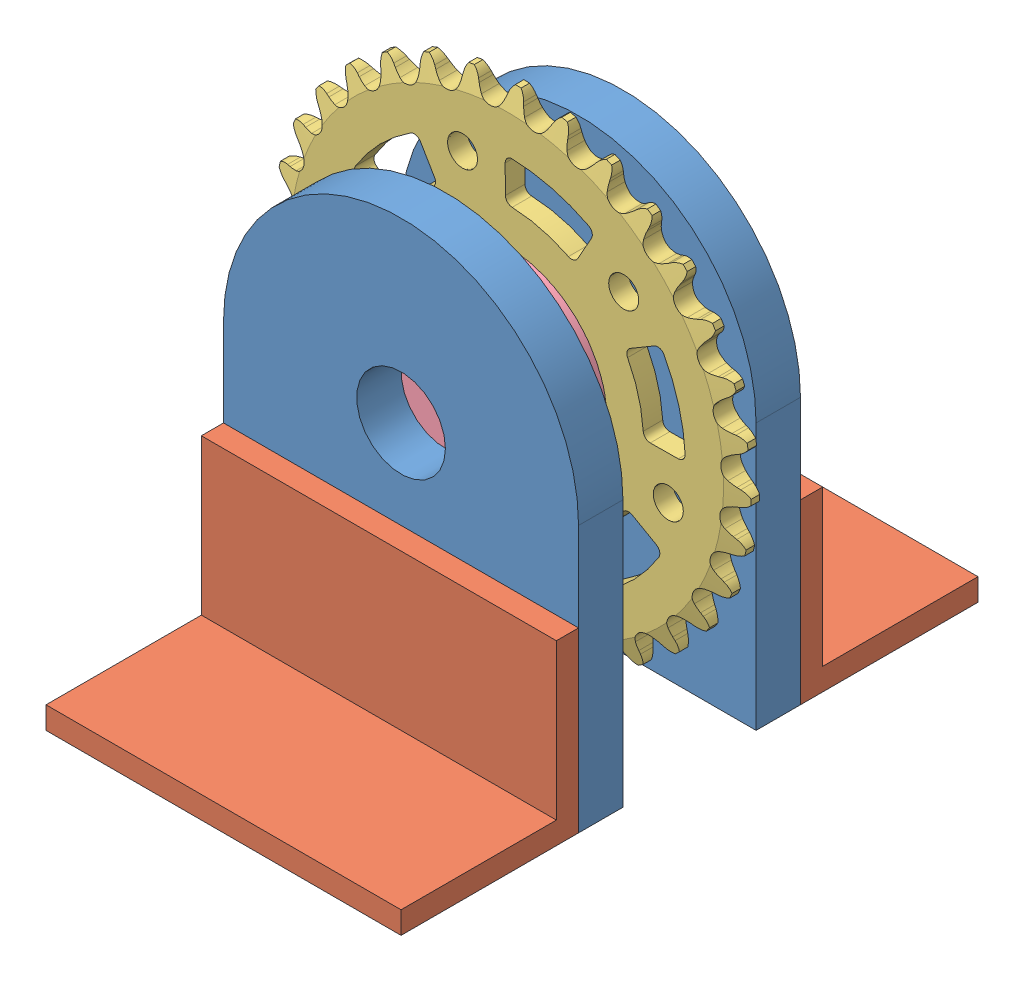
SolidWorks assembly Bottom Sprocket.SLDASM, configuration Default (file format 7000). Lengths in mm.
Overall size (83.76 83.76 82.55).
6 component instances, 4 part files, 12 mates.
Components (placement in the parent):
- Bottom sprocket mount-1: Bottom sprocket mount.SLDPRT [Default] at (2.3148 27.7191 63.7093) size (50.8 63.5 6.35)
- Sprocket mount to the bottom-1: Sprocket mount to the bottom.SLDPRT [Default] at (2.3148 8.6691 79.5843) size (50.8 25.4 25.4)
- 2_32tvexsprocket-1: 2_32tvexsprocket.SLDPRT [Default] at (2.3148 34.0691 48.9122) x (0.963427 0.26797 0) z (0 0 1) size (68.02 68.02 2.79)
- flanged round bearing half inch-1: flanged round bearing half inch.SLDPRT [Default] at (2.3148 34.0691 55.2622) x (1 0 0) z (0 1 0) size (31.12 7.94 31.12)
- Sprocket mount to the bottom-2: Sprocket mount to the bottom.SLDPRT [Default] at (2.3148 8.6691 22.4343) x (-1 0 0) z (0 0 -1) size (50.8 25.4 25.4)
- Bottom sprocket mount-2: Bottom sprocket mount.SLDPRT [Default] at (2.3148 27.7191 38.3093) x (-1 0 0) z (0 0 -1) size (50.8 63.5 6.35)
Mates (geometry in assembly coordinates):
- Concentric1: concentric aligned: cylinder of Bottom sprocket mount-1 through (2.3148 34.0691 60.5343) axis (0 0 1) radius 6.35; cylinder of 2_32tvexsprocket-1 through (2.3148 34.0691 48.9122) axis (0 0 1) radius 14.3
- Coincident1: coincident anti-aligned: plane of Bottom sprocket mount-1 through (2.3148 34.0691 66.8843) normal (0 0 1); plane of Sprocket mount to the bottom-1 through (27.7148 -4.0309 66.8843) normal (0 0 -1)
- Coincident2: coincident aligned: plane of Bottom sprocket mount-1 through (-23.0852 -4.0309 66.8843) normal (0 -1 0); plane of Sprocket mount to the bottom-1 through (27.7148 -4.0309 92.2843) normal (0 -1 0)
- Coincident3: coincident aligned: plane of Bottom sprocket mount-1 through (27.7148 34.0691 66.8843) normal (1 0 0); plane of Sprocket mount to the bottom-1 through (27.7148 8.6691 79.5843) normal (1 0 0)
- Concentric2: concentric anti-aligned: cylinder of 2_32tvexsprocket-1 through (2.3148 34.0691 48.9122) axis (0 0 1) radius 14.3; cylinder of flanged round bearing half inch-1 through (2.3148 34.0691 55.2622) axis (0 0 -1) radius 6.35
- Coincident5: coincident anti-aligned: plane of 2_32tvexsprocket-1 through (2.3148 34.0691 48.9122) normal (0 0 -1); plane of flanged round bearing half inch-1 through (17.8723 34.0691 48.9122) normal (0 0 1)
- Distance1: distance = 25.4 mm aligned: plane of Bottom sprocket mount-2 through (2.3148 34.0691 35.1343) normal (0 0 -1); plane of Bottom sprocket mount-1 through (2.3148 34.0691 60.5343) normal (0 0 -1)
- Coincident7: coincident aligned: plane of Bottom sprocket mount-1 through (27.7148 34.0691 66.8843) normal (1 0 0); plane of Bottom sprocket mount-2 through (27.7148 34.0691 35.1343) normal (1 0 0)
- Coincident8: coincident aligned: plane of Bottom sprocket mount-1 through (-23.0852 -4.0309 66.8843) normal (0 -1 0); plane of Bottom sprocket mount-2 through (27.7148 -4.0309 35.1343) normal (0 -1 0)
- Coincident9: coincident anti-aligned: plane of Sprocket mount to the bottom-2 through (-23.0852 -4.0309 35.1343) normal (0 0 1); plane of Bottom sprocket mount-2 through (2.3148 34.0691 35.1343) normal (0 0 -1)
- Coincident10: coincident aligned: plane of Sprocket mount to the bottom-2 through (27.7148 8.6691 22.4343) normal (1 0 0); plane of Bottom sprocket mount-2 through (27.7148 34.0691 35.1343) normal (1 0 0)
- Coincident11: coincident aligned: plane of Sprocket mount to the bottom-2 through (-23.0852 -4.0309 9.7343) normal (0 -1 0); plane of Bottom sprocket mount-2 through (27.7148 -4.0309 35.1343) normal (0 -1 0)
